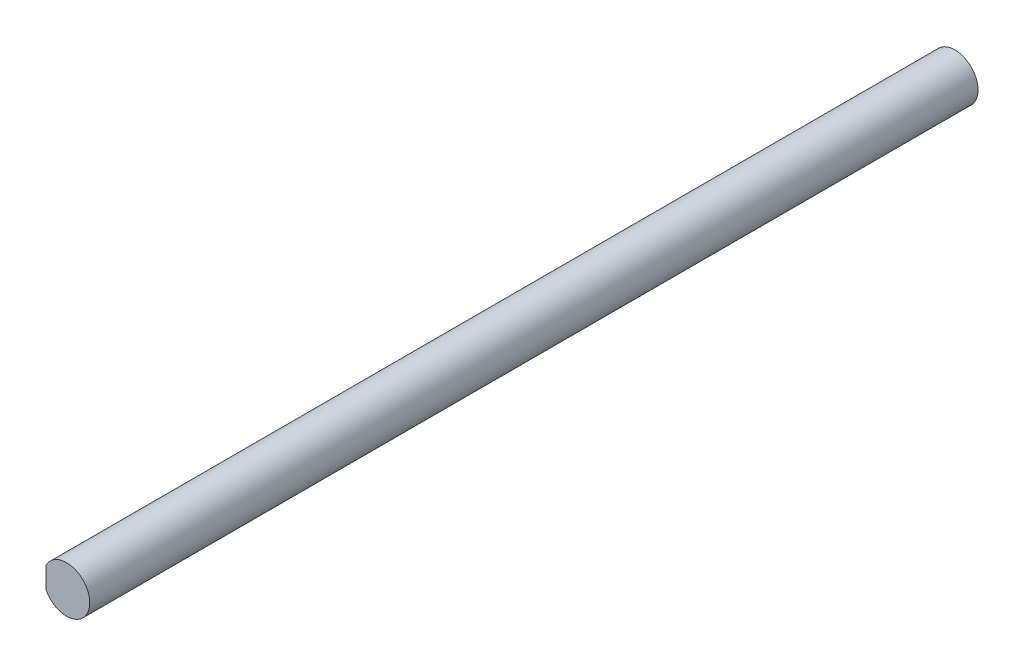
ISO-10303-21;
HEADER;
FILE_DESCRIPTION(('STEP AP214'),'2;1');
FILE_NAME('part.step','',(''),(''),'','','');
FILE_SCHEMA(('AUTOMOTIVE_DESIGN { 1 0 10303 214 1 1 1 1 }'));
ENDSEC;
DATA;
#1=APPLICATION_CONTEXT('core data for automotive mechanical design processes');
#2=APPLICATION_PROTOCOL_DEFINITION('international standard','automotive_design',2000,#1);
#3=PRODUCT_CONTEXT('',#1,'mechanical');
#4=PRODUCT('Part','Part','',(#3));
#5=PRODUCT_RELATED_PRODUCT_CATEGORY('part','',(#4));
#6=PRODUCT_DEFINITION_FORMATION('','',#4);
#7=PRODUCT_DEFINITION_CONTEXT('part definition',#1,'design');
#8=PRODUCT_DEFINITION('design','',#6,#7);
#9=PRODUCT_DEFINITION_SHAPE('','',#8);
#10=(LENGTH_UNIT() NAMED_UNIT(*) SI_UNIT(.MILLI.,.METRE.));
#11=(NAMED_UNIT(*) PLANE_ANGLE_UNIT() SI_UNIT($,.RADIAN.));
#12=(NAMED_UNIT(*) SI_UNIT($,.STERADIAN.) SOLID_ANGLE_UNIT());
#13=UNCERTAINTY_MEASURE_WITH_UNIT(LENGTH_MEASURE(1.E-05),#10,'distance_accuracy_value','');
#14=(GEOMETRIC_REPRESENTATION_CONTEXT(3) GLOBAL_UNCERTAINTY_ASSIGNED_CONTEXT((#13)) GLOBAL_UNIT_ASSIGNED_CONTEXT((#10,
#11,#12)) REPRESENTATION_CONTEXT('',''));
#15=CARTESIAN_POINT('',(0.,0.,0.));
#16=DIRECTION('',(0.,0.,1.));
#17=DIRECTION('',(1.,0.,0.));
#18=AXIS2_PLACEMENT_3D('',#15,#16,#17);
#19=CARTESIAN_POINT('',(30.,134.397130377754,-345.));
#20=DIRECTION('',(0.,0.,1.));
#21=DIRECTION('',(1.,0.,0.));
#22=AXIS2_PLACEMENT_3D('',#19,#20,#21);
#23=CYLINDRICAL_SURFACE('',#22,18.);
#24=DIRECTION('',(0.,0.,1.));
#25=VECTOR('',#24,1.);
#26=CARTESIAN_POINT('',(14.,126.150919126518,295.));
#27=LINE('',#26,#25);
#28=CARTESIAN_POINT('',(14.,126.150919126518,295.));
#29=VERTEX_POINT('',#28);
#30=CARTESIAN_POINT('',(14.,126.150919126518,345.));
#31=VERTEX_POINT('',#30);
#32=EDGE_CURVE('E39',#29,#31,#27,.T.);
#33=ORIENTED_EDGE('',*,*,#32,.F.);
#34=CARTESIAN_POINT('',(30.,134.397130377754,295.));
#35=DIRECTION('',(0.,0.,1.));
#36=DIRECTION('',(1.,0.,0.));
#37=AXIS2_PLACEMENT_3D('',#34,#35,#36);
#38=CIRCLE('',#37,18.);
#39=CARTESIAN_POINT('',(14.,142.643341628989,295.));
#40=VERTEX_POINT('',#39);
#41=EDGE_CURVE('E24',#29,#40,#38,.F.);
#42=ORIENTED_EDGE('',*,*,#41,.T.);
#43=DIRECTION('',(0.,0.,1.));
#44=VECTOR('',#43,1.);
#45=CARTESIAN_POINT('',(14.,142.643341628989,295.));
#46=LINE('',#45,#44);
#47=CARTESIAN_POINT('',(14.,142.643341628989,345.));
#48=VERTEX_POINT('',#47);
#49=EDGE_CURVE('E77',#40,#48,#46,.T.);
#50=ORIENTED_EDGE('',*,*,#49,.T.);
#51=CARTESIAN_POINT('',(30.,134.397130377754,345.));
#52=DIRECTION('',(0.,0.,1.));
#53=DIRECTION('',(1.,0.,0.));
#54=AXIS2_PLACEMENT_3D('',#51,#52,#53);
#55=CIRCLE('',#54,18.);
#56=EDGE_CURVE('E80',#31,#48,#55,.T.);
#57=ORIENTED_EDGE('',*,*,#56,.F.);
#58=EDGE_LOOP('',(#33,#42,#50,#57));
#59=FACE_BOUND('',#58,.T.);
#60=CARTESIAN_POINT('',(30.,134.397130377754,-345.));
#61=DIRECTION('',(0.,0.,1.));
#62=DIRECTION('',(1.,0.,0.));
#63=AXIS2_PLACEMENT_3D('',#60,#61,#62);
#64=CIRCLE('',#63,18.);
#65=CARTESIAN_POINT('',(14.,126.150919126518,-345.));
#66=VERTEX_POINT('',#65);
#67=CARTESIAN_POINT('',(14.,142.643341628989,-345.));
#68=VERTEX_POINT('',#67);
#69=EDGE_CURVE('E69',#66,#68,#64,.T.);
#70=ORIENTED_EDGE('',*,*,#69,.T.);
#71=DIRECTION('',(0.,0.,-1.));
#72=VECTOR('',#71,1.);
#73=CARTESIAN_POINT('',(14.,142.643341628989,-295.));
#74=LINE('',#73,#72);
#75=CARTESIAN_POINT('',(14.,142.643341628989,-295.));
#76=VERTEX_POINT('',#75);
#77=EDGE_CURVE('E31',#76,#68,#74,.T.);
#78=ORIENTED_EDGE('',*,*,#77,.F.);
#79=CARTESIAN_POINT('',(30.,134.397130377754,-295.));
#80=DIRECTION('',(0.,0.,-1.));
#81=DIRECTION('',(-1.,0.,0.));
#82=AXIS2_PLACEMENT_3D('',#79,#80,#81);
#83=CIRCLE('',#82,18.);
#84=CARTESIAN_POINT('',(14.,126.150919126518,-295.));
#85=VERTEX_POINT('',#84);
#86=EDGE_CURVE('E11',#76,#85,#83,.F.);
#87=ORIENTED_EDGE('',*,*,#86,.T.);
#88=DIRECTION('',(0.,0.,-1.));
#89=VECTOR('',#88,1.);
#90=CARTESIAN_POINT('',(14.,126.150919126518,-295.));
#91=LINE('',#90,#89);
#92=EDGE_CURVE('E57',#85,#66,#91,.T.);
#93=ORIENTED_EDGE('',*,*,#92,.T.);
#94=EDGE_LOOP('',(#70,#78,#87,#93));
#95=FACE_BOUND('',#94,.T.);
#96=ADVANCED_FACE('F17',(#59,#95),#23,.T.);
#97=CARTESIAN_POINT('',(30.,134.397130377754,-345.));
#98=DIRECTION('',(0.,0.,1.));
#99=DIRECTION('',(1.,0.,0.));
#100=AXIS2_PLACEMENT_3D('',#97,#98,#99);
#101=PLANE('',#100);
#102=DIRECTION('',(0.,1.,0.));
#103=VECTOR('',#102,1.);
#104=CARTESIAN_POINT('',(14.,142.643341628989,-345.));
#105=LINE('',#104,#103);
#106=EDGE_CURVE('E61',#66,#68,#105,.T.);
#107=ORIENTED_EDGE('',*,*,#106,.T.);
#108=ORIENTED_EDGE('',*,*,#69,.F.);
#109=EDGE_LOOP('',(#107,#108));
#110=FACE_BOUND('',#109,.T.);
#111=ADVANCED_FACE('F94',(#110),#101,.F.);
#112=CARTESIAN_POINT('',(30.,134.397130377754,345.));
#113=DIRECTION('',(0.,0.,1.));
#114=DIRECTION('',(1.,0.,0.));
#115=AXIS2_PLACEMENT_3D('',#112,#113,#114);
#116=PLANE('',#115);
#117=DIRECTION('',(0.,1.,0.));
#118=VECTOR('',#117,1.);
#119=CARTESIAN_POINT('',(14.,142.643341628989,345.));
#120=LINE('',#119,#118);
#121=EDGE_CURVE('E70',#31,#48,#120,.T.);
#122=ORIENTED_EDGE('',*,*,#121,.F.);
#123=ORIENTED_EDGE('',*,*,#56,.T.);
#124=EDGE_LOOP('',(#122,#123));
#125=FACE_BOUND('',#124,.T.);
#126=ADVANCED_FACE('F92',(#125),#116,.T.);
#127=CARTESIAN_POINT('',(14.,142.643341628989,295.));
#128=DIRECTION('',(1.,0.,0.));
#129=DIRECTION('',(0.,0.,-1.));
#130=AXIS2_PLACEMENT_3D('',#127,#128,#129);
#131=PLANE('',#130);
#132=ORIENTED_EDGE('',*,*,#121,.T.);
#133=ORIENTED_EDGE('',*,*,#49,.F.);
#134=DIRECTION('',(0.,1.,0.));
#135=VECTOR('',#134,1.);
#136=CARTESIAN_POINT('',(14.,142.643341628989,295.));
#137=LINE('',#136,#135);
#138=EDGE_CURVE('E72',#29,#40,#137,.T.);
#139=ORIENTED_EDGE('',*,*,#138,.F.);
#140=ORIENTED_EDGE('',*,*,#32,.T.);
#141=EDGE_LOOP('',(#132,#133,#139,#140));
#142=FACE_BOUND('',#141,.T.);
#143=ADVANCED_FACE('F90',(#142),#131,.F.);
#144=CARTESIAN_POINT('',(14.,126.150919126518,295.));
#145=DIRECTION('',(0.,0.,1.));
#146=DIRECTION('',(1.,0.,0.));
#147=AXIS2_PLACEMENT_3D('',#144,#145,#146);
#148=PLANE('',#147);
#149=ORIENTED_EDGE('',*,*,#138,.T.);
#150=ORIENTED_EDGE('',*,*,#41,.F.);
#151=EDGE_LOOP('',(#149,#150));
#152=FACE_BOUND('',#151,.T.);
#153=ADVANCED_FACE('F89',(#152),#148,.T.);
#154=CARTESIAN_POINT('',(14.,142.643341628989,-295.));
#155=DIRECTION('',(-1.,0.,0.));
#156=DIRECTION('',(0.,0.,1.));
#157=AXIS2_PLACEMENT_3D('',#154,#155,#156);
#158=PLANE('',#157);
#159=ORIENTED_EDGE('',*,*,#106,.F.);
#160=ORIENTED_EDGE('',*,*,#92,.F.);
#161=DIRECTION('',(0.,1.,0.));
#162=VECTOR('',#161,1.);
#163=CARTESIAN_POINT('',(14.,142.643341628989,-295.));
#164=LINE('',#163,#162);
#165=EDGE_CURVE('E60',#85,#76,#164,.T.);
#166=ORIENTED_EDGE('',*,*,#165,.T.);
#167=ORIENTED_EDGE('',*,*,#77,.T.);
#168=EDGE_LOOP('',(#159,#160,#166,#167));
#169=FACE_BOUND('',#168,.T.);
#170=ADVANCED_FACE('F59',(#169),#158,.T.);
#171=CARTESIAN_POINT('',(14.,126.150919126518,-295.));
#172=DIRECTION('',(0.,0.,-1.));
#173=DIRECTION('',(1.,0.,0.));
#174=AXIS2_PLACEMENT_3D('',#171,#172,#173);
#175=PLANE('',#174);
#176=ORIENTED_EDGE('',*,*,#165,.F.);
#177=ORIENTED_EDGE('',*,*,#86,.F.);
#178=EDGE_LOOP('',(#176,#177));
#179=FACE_BOUND('',#178,.T.);
#180=ADVANCED_FACE('F67',(#179),#175,.T.);
#181=CLOSED_SHELL('',(#96,#111,#126,#143,#153,#170,#180));
#182=MANIFOLD_SOLID_BREP('B1',#181);
#183=ADVANCED_BREP_SHAPE_REPRESENTATION('',(#18,#182),#14);
#184=SHAPE_DEFINITION_REPRESENTATION(#9,#183);
ENDSEC;
END-ISO-10303-21;
